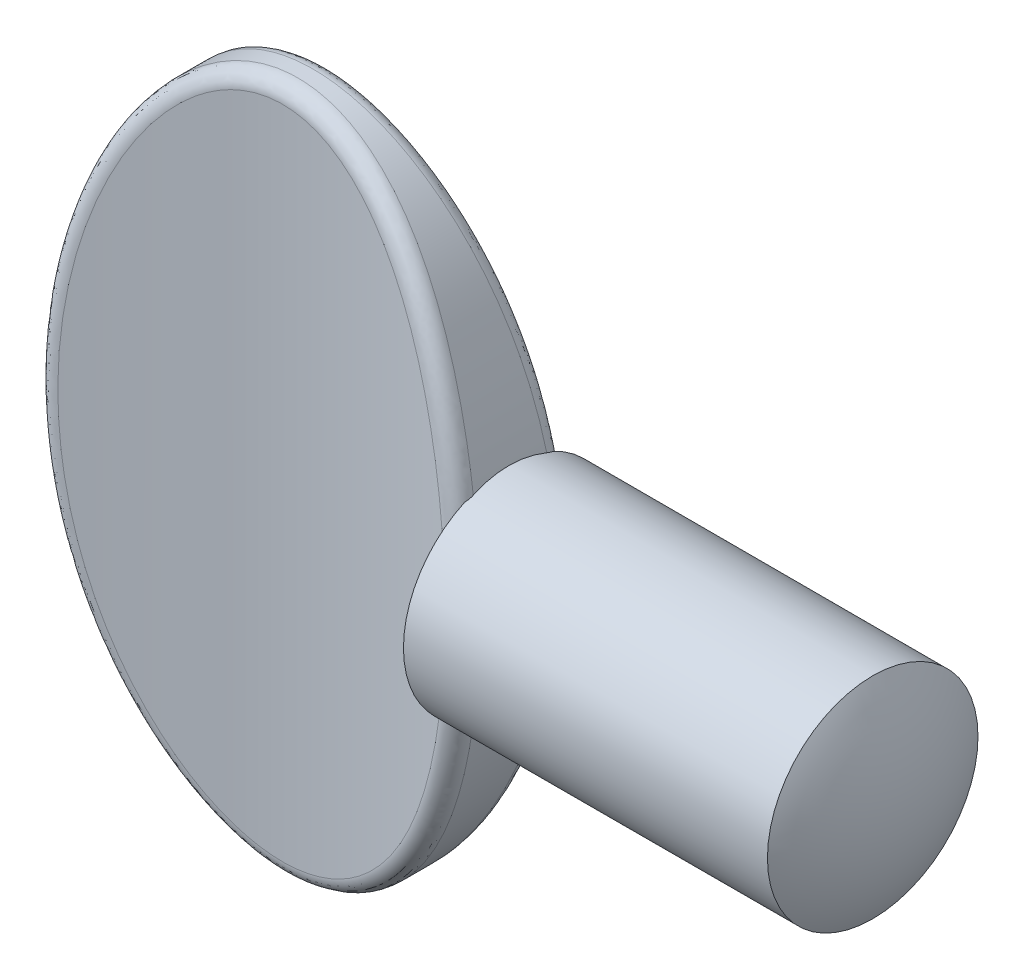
from build123d import *

# Parameters (mm, degrees)
SKETCH1_RX              = 5.715
SKETCH1_RY              = 3.556
EXTRUDE1_DEPTH          = 1.016
CUT_EXTRUDE1_DEPTH      = 7.8072473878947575
CUT_EXTRUDE1_DEPTH_BACK = 7.8072473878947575
SKETCH2_OUTSIDE_W       = 11.834000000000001
SKETCH2_OUTSIDE_H       = 6.754
FILLET3_R               = 0.254


with BuildPart() as part:
    # Sketch1 → Extrude1 (new, symmetric)
    with BuildSketch(Plane.XY):
        with Locations(Location((0, 0), (0, 0, -90))):
            Ellipse(SKETCH1_RX, SKETCH1_RY)
    extrude(amount=EXTRUDE1_DEPTH, both=True)

    # Sketch2 outside → Cut-Extrude1 (cut, two sides: drawn at the far end of the back side and taken through both)
    with BuildSketch(Plane(origin=(0, 0, 0), x_dir=(1, 0, 0), z_dir=(0, 1, 0)).offset(-CUT_EXTRUDE1_DEPTH_BACK)):
        Rectangle(SKETCH2_OUTSIDE_W, SKETCH2_OUTSIDE_H)
        with BuildLine():
            Line((-3.556, 1.016), (-3.556, -1.016))
            ThreePointArc((-3.556, -1.016), (6.3e-16, -0.3810000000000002), (3.556, -1.016))
            Line((3.556, -1.016), (3.556, 1.016))
            ThreePointArc((3.556, 1.016), (6.3e-16, 0.3810000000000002), (-3.556, 1.016))
        make_face(mode=Mode.SUBTRACT)
    extrude(amount=CUT_EXTRUDE1_DEPTH + CUT_EXTRUDE1_DEPTH_BACK, mode=Mode.SUBTRACT)

    # Fillet3
    fillet3_edges = [part.edges().sort_by_distance(p)[0] for p in [
        (-2.772297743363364, -3.579097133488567, 0.7620899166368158),
        (6.761380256e-08, 5.714999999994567, -0.38099999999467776),
    ]]
    fillet(fillet3_edges, radius=FILLET3_R)

    # Sketch3 → Revolve1 (revolve)
    with BuildSketch(Plane(origin=(0, 0, 0), x_dir=(1, 0, 0), z_dir=(0, 1, 0)), mode=Mode.PRIVATE) as revolve1_sk:
        with BuildLine():
            Line((4.741333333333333, 1.7526), (9.444112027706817, 1.7526))
            ThreePointArc((9.444112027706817, 1.7526), (9.788589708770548, 0.9062211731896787), (9.906, 0))
            Line((9.906, 0), (2.577464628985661, 1e-17))
            Line((2.577464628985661, 1e-17), (2.577464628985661, 0.7095513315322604))
            ThreePointArc((2.577464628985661, 0.7095513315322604), (3.1592934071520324, 1.093146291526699), (3.3846611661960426, 1.7526000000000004))
            Line((3.3846611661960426, 1.7526000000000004), (4.741333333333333, 1.7526))
        make_face()
    revolve(revolve1_sk.sketch.rotate(Axis((0, 0, 0), (1, 0, 0)), 180), axis=Axis((0, 0, 0), (1, 0, 0)))


solid = part.part
